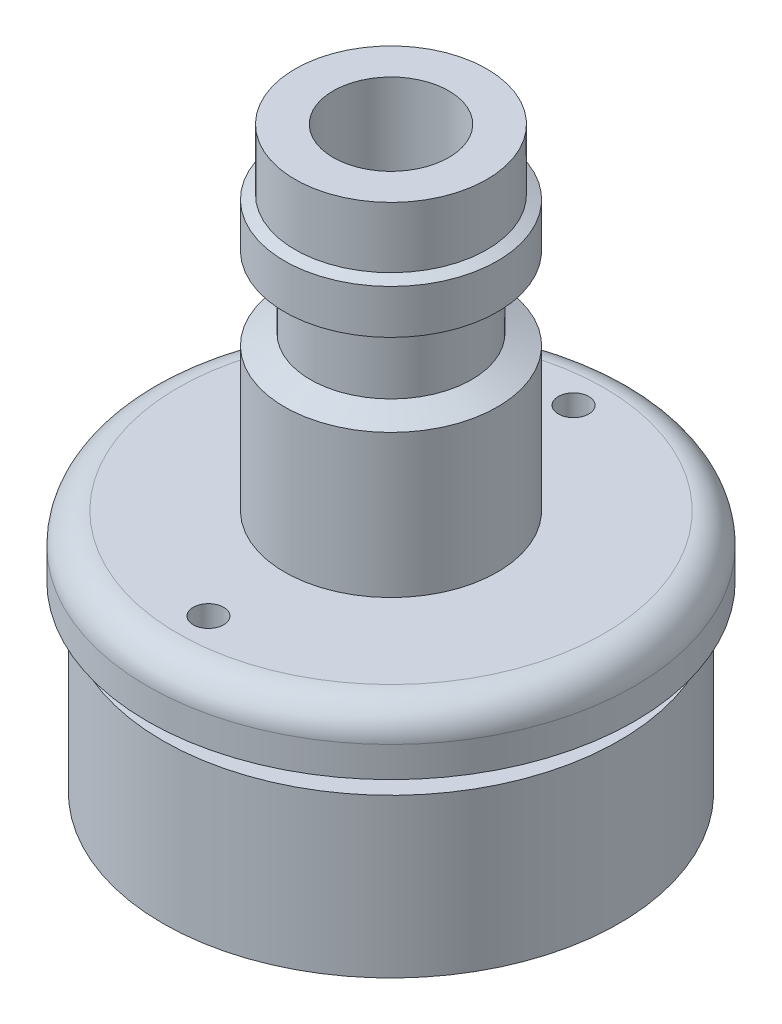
ISO-10303-21;
HEADER;
FILE_DESCRIPTION(('STEP AP214'),'2;1');
FILE_NAME('part.step','',(''),(''),'','','');
FILE_SCHEMA(('AUTOMOTIVE_DESIGN { 1 0 10303 214 1 1 1 1 }'));
ENDSEC;
DATA;
#1=APPLICATION_CONTEXT('core data for automotive mechanical design processes');
#2=APPLICATION_PROTOCOL_DEFINITION('international standard','automotive_design',2000,#1);
#3=PRODUCT_CONTEXT('',#1,'mechanical');
#4=PRODUCT('Part','Part','',(#3));
#5=PRODUCT_RELATED_PRODUCT_CATEGORY('part','',(#4));
#6=PRODUCT_DEFINITION_FORMATION('','',#4);
#7=PRODUCT_DEFINITION_CONTEXT('part definition',#1,'design');
#8=PRODUCT_DEFINITION('design','',#6,#7);
#9=PRODUCT_DEFINITION_SHAPE('','',#8);
#10=(LENGTH_UNIT() NAMED_UNIT(*) SI_UNIT(.MILLI.,.METRE.));
#11=(NAMED_UNIT(*) PLANE_ANGLE_UNIT() SI_UNIT($,.RADIAN.));
#12=(NAMED_UNIT(*) SI_UNIT($,.STERADIAN.) SOLID_ANGLE_UNIT());
#13=UNCERTAINTY_MEASURE_WITH_UNIT(LENGTH_MEASURE(1.E-05),#10,'distance_accuracy_value','');
#14=(GEOMETRIC_REPRESENTATION_CONTEXT(3) GLOBAL_UNCERTAINTY_ASSIGNED_CONTEXT((#13)) GLOBAL_UNIT_ASSIGNED_CONTEXT((#10,
#11,#12)) REPRESENTATION_CONTEXT('',''));
#15=CARTESIAN_POINT('',(0.,0.,0.));
#16=DIRECTION('',(0.,0.,1.));
#17=DIRECTION('',(1.,0.,0.));
#18=AXIS2_PLACEMENT_3D('',#15,#16,#17);
#19=CARTESIAN_POINT('',(8.89,2.54,0.));
#20=DIRECTION('',(0.,1.,0.));
#21=DIRECTION('',(0.,0.,1.));
#22=AXIS2_PLACEMENT_3D('',#19,#20,#21);
#23=PLANE('',#22);
#24=CARTESIAN_POINT('',(0.,2.54,0.));
#25=DIRECTION('',(0.,-1.,0.));
#26=DIRECTION('',(0.,0.,-1.));
#27=AXIS2_PLACEMENT_3D('',#24,#25,#26);
#28=CIRCLE('',#27,8.89);
#29=CARTESIAN_POINT('',(0.,2.54,-8.89));
#30=VERTEX_POINT('',#29);
#31=EDGE_CURVE('E58',#30,#30,#28,.T.);
#32=ORIENTED_EDGE('',*,*,#31,.F.);
#33=EDGE_LOOP('',(#32));
#34=FACE_BOUND('',#33,.T.);
#35=CARTESIAN_POINT('',(0.,2.54,0.));
#36=DIRECTION('',(0.,-1.,0.));
#37=DIRECTION('',(0.,0.,-1.));
#38=AXIS2_PLACEMENT_3D('',#35,#36,#37);
#39=CIRCLE('',#38,4.445);
#40=CARTESIAN_POINT('',(0.,2.54,-4.445));
#41=VERTEX_POINT('',#40);
#42=EDGE_CURVE('E61',#41,#41,#39,.T.);
#43=ORIENTED_EDGE('',*,*,#42,.T.);
#44=EDGE_LOOP('',(#43));
#45=FACE_BOUND('',#44,.T.);
#46=CARTESIAN_POINT('',(0.,2.54,-7.62));
#47=DIRECTION('',(0.,1.,0.));
#48=DIRECTION('',(0.,0.,1.));
#49=AXIS2_PLACEMENT_3D('',#46,#47,#48);
#50=CIRCLE('',#49,0.635);
#51=CARTESIAN_POINT('',(0.,2.54,-6.985));
#52=VERTEX_POINT('',#51);
#53=EDGE_CURVE('E97',#52,#52,#50,.T.);
#54=ORIENTED_EDGE('',*,*,#53,.F.);
#55=EDGE_LOOP('',(#54));
#56=FACE_BOUND('',#55,.T.);
#57=CARTESIAN_POINT('',(0.,2.54,7.62));
#58=DIRECTION('',(0.,-1.,0.));
#59=DIRECTION('',(0.,0.,-1.));
#60=AXIS2_PLACEMENT_3D('',#57,#58,#59);
#61=CIRCLE('',#60,0.635);
#62=CARTESIAN_POINT('',(0.,2.54,6.985));
#63=VERTEX_POINT('',#62);
#64=EDGE_CURVE('E103',#63,#63,#61,.T.);
#65=ORIENTED_EDGE('',*,*,#64,.T.);
#66=EDGE_LOOP('',(#65));
#67=FACE_BOUND('',#66,.T.);
#68=ADVANCED_FACE('F26',(#34,#45,#56,#67),#23,.T.);
#69=CARTESIAN_POINT('',(4.0005,16.51,0.));
#70=DIRECTION('',(0.,1.,0.));
#71=DIRECTION('',(0.,0.,1.));
#72=AXIS2_PLACEMENT_3D('',#69,#70,#71);
#73=PLANE('',#72);
#74=CARTESIAN_POINT('',(0.,16.51,0.));
#75=DIRECTION('',(0.,-1.,0.));
#76=DIRECTION('',(0.,0.,-1.));
#77=AXIS2_PLACEMENT_3D('',#74,#75,#76);
#78=CIRCLE('',#77,4.0005);
#79=CARTESIAN_POINT('',(0.,16.51,-4.0005));
#80=VERTEX_POINT('',#79);
#81=EDGE_CURVE('E82',#80,#80,#78,.T.);
#82=ORIENTED_EDGE('',*,*,#81,.F.);
#83=EDGE_LOOP('',(#82));
#84=FACE_BOUND('',#83,.T.);
#85=CARTESIAN_POINT('',(0.,16.51,0.));
#86=DIRECTION('',(0.,1.,0.));
#87=DIRECTION('',(0.,0.,1.));
#88=AXIS2_PLACEMENT_3D('',#85,#86,#87);
#89=CIRCLE('',#88,2.413);
#90=CARTESIAN_POINT('',(0.,16.51,2.413));
#91=VERTEX_POINT('',#90);
#92=EDGE_CURVE('E91',#91,#91,#89,.T.);
#93=ORIENTED_EDGE('',*,*,#92,.F.);
#94=EDGE_LOOP('',(#93));
#95=FACE_BOUND('',#94,.T.);
#96=ADVANCED_FACE('F124',(#84,#95),#73,.T.);
#97=CARTESIAN_POINT('',(0.,0.,0.));
#98=DIRECTION('',(0.,1.,0.));
#99=DIRECTION('',(0.,0.,1.));
#100=AXIS2_PLACEMENT_3D('',#97,#98,#99);
#101=PLANE('',#100);
#102=CARTESIAN_POINT('',(0.,0.,0.));
#103=DIRECTION('',(0.,1.,0.));
#104=DIRECTION('',(0.,0.,1.));
#105=AXIS2_PLACEMENT_3D('',#102,#103,#104);
#106=CIRCLE('',#105,4.19100000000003);
#107=CARTESIAN_POINT('',(0.,0.,4.19100000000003));
#108=VERTEX_POINT('',#107);
#109=EDGE_CURVE('E33',#108,#108,#106,.T.);
#110=ORIENTED_EDGE('',*,*,#109,.T.);
#111=EDGE_LOOP('',(#110));
#112=FACE_BOUND('',#111,.T.);
#113=CARTESIAN_POINT('',(0.,0.,0.));
#114=DIRECTION('',(0.,1.,0.));
#115=DIRECTION('',(0.,0.,1.));
#116=AXIS2_PLACEMENT_3D('',#113,#114,#115);
#117=CIRCLE('',#116,7.1374);
#118=CARTESIAN_POINT('',(0.,0.,7.1374));
#119=VERTEX_POINT('',#118);
#120=EDGE_CURVE('E88',#119,#119,#117,.T.);
#121=ORIENTED_EDGE('',*,*,#120,.F.);
#122=EDGE_LOOP('',(#121));
#123=FACE_BOUND('',#122,.T.);
#124=ADVANCED_FACE('F132',(#112,#123),#101,.F.);
#125=CARTESIAN_POINT('',(0.,-7.62,0.));
#126=DIRECTION('',(0.,1.,0.));
#127=DIRECTION('',(0.,0.,1.));
#128=AXIS2_PLACEMENT_3D('',#125,#126,#127);
#129=CYLINDRICAL_SURFACE('',#128,9.525);
#130=CARTESIAN_POINT('',(0.,-7.62,0.));
#131=DIRECTION('',(0.,1.,0.));
#132=DIRECTION('',(0.,0.,1.));
#133=AXIS2_PLACEMENT_3D('',#130,#131,#132);
#134=CIRCLE('',#133,9.525);
#135=CARTESIAN_POINT('',(0.,-7.62,9.525));
#136=VERTEX_POINT('',#135);
#137=EDGE_CURVE('E37',#136,#136,#134,.T.);
#138=CARTESIAN_POINT('',(0.,-1.016,0.));
#139=DIRECTION('',(0.,1.,0.));
#140=DIRECTION('',(0.,0.,1.));
#141=AXIS2_PLACEMENT_3D('',#138,#139,#140);
#142=CIRCLE('',#141,9.525);
#143=CARTESIAN_POINT('',(0.,-1.016,9.525));
#144=VERTEX_POINT('',#143);
#145=EDGE_CURVE('E41',#144,#144,#142,.F.);
#146=CARTESIAN_POINT('',(0.,-7.62,9.525));
#147=CARTESIAN_POINT('',(0.,-7.55120833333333,9.525));
#148=CARTESIAN_POINT('',(0.,-7.48241666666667,9.525));
#149=CARTESIAN_POINT('',(0.,-7.34483333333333,9.525));
#150=CARTESIAN_POINT('',(0.,-7.27604166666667,9.525));
#151=CARTESIAN_POINT('',(0.,-7.13845833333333,9.525));
#152=CARTESIAN_POINT('',(0.,-7.06966666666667,9.525));
#153=CARTESIAN_POINT('',(0.,-6.93208333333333,9.525));
#154=CARTESIAN_POINT('',(0.,-6.86329166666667,9.525));
#155=CARTESIAN_POINT('',(0.,-6.72570833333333,9.525));
#156=CARTESIAN_POINT('',(0.,-6.65691666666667,9.525));
#157=CARTESIAN_POINT('',(0.,-6.51933333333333,9.525));
#158=CARTESIAN_POINT('',(0.,-6.45054166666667,9.525));
#159=CARTESIAN_POINT('',(0.,-6.31295833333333,9.525));
#160=CARTESIAN_POINT('',(0.,-6.24416666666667,9.525));
#161=CARTESIAN_POINT('',(0.,-6.10658333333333,9.525));
#162=CARTESIAN_POINT('',(0.,-6.03779166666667,9.525));
#163=CARTESIAN_POINT('',(0.,-5.90020833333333,9.525));
#164=CARTESIAN_POINT('',(0.,-5.83141666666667,9.525));
#165=CARTESIAN_POINT('',(0.,-5.69383333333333,9.525));
#166=CARTESIAN_POINT('',(0.,-5.62504166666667,9.525));
#167=CARTESIAN_POINT('',(0.,-5.48745833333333,9.525));
#168=CARTESIAN_POINT('',(0.,-5.41866666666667,9.525));
#169=CARTESIAN_POINT('',(0.,-5.28108333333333,9.525));
#170=CARTESIAN_POINT('',(0.,-5.21229166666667,9.525));
#171=CARTESIAN_POINT('',(0.,-5.07470833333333,9.525));
#172=CARTESIAN_POINT('',(0.,-5.00591666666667,9.525));
#173=CARTESIAN_POINT('',(0.,-4.86833333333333,9.525));
#174=CARTESIAN_POINT('',(0.,-4.79954166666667,9.525));
#175=CARTESIAN_POINT('',(0.,-4.66195833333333,9.525));
#176=CARTESIAN_POINT('',(0.,-4.59316666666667,9.525));
#177=CARTESIAN_POINT('',(0.,-4.45558333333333,9.525));
#178=CARTESIAN_POINT('',(0.,-4.38679166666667,9.525));
#179=CARTESIAN_POINT('',(0.,-4.24920833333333,9.525));
#180=CARTESIAN_POINT('',(0.,-4.18041666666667,9.525));
#181=CARTESIAN_POINT('',(0.,-4.04283333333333,9.525));
#182=CARTESIAN_POINT('',(0.,-3.97404166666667,9.525));
#183=CARTESIAN_POINT('',(0.,-3.83645833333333,9.525));
#184=CARTESIAN_POINT('',(0.,-3.76766666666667,9.525));
#185=CARTESIAN_POINT('',(0.,-3.63008333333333,9.525));
#186=CARTESIAN_POINT('',(0.,-3.56129166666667,9.525));
#187=CARTESIAN_POINT('',(0.,-3.42370833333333,9.525));
#188=CARTESIAN_POINT('',(0.,-3.35491666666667,9.525));
#189=CARTESIAN_POINT('',(0.,-3.21733333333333,9.525));
#190=CARTESIAN_POINT('',(0.,-3.14854166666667,9.525));
#191=CARTESIAN_POINT('',(0.,-3.01095833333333,9.525));
#192=CARTESIAN_POINT('',(0.,-2.94216666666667,9.525));
#193=CARTESIAN_POINT('',(0.,-2.80458333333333,9.525));
#194=CARTESIAN_POINT('',(0.,-2.73579166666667,9.525));
#195=CARTESIAN_POINT('',(0.,-2.59820833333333,9.525));
#196=CARTESIAN_POINT('',(0.,-2.52941666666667,9.525));
#197=CARTESIAN_POINT('',(0.,-2.39183333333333,9.525));
#198=CARTESIAN_POINT('',(0.,-2.32304166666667,9.525));
#199=CARTESIAN_POINT('',(0.,-2.18545833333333,9.525));
#200=CARTESIAN_POINT('',(0.,-2.11666666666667,9.525));
#201=CARTESIAN_POINT('',(0.,-1.97908333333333,9.525));
#202=CARTESIAN_POINT('',(0.,-1.91029166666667,9.525));
#203=CARTESIAN_POINT('',(0.,-1.77270833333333,9.525));
#204=CARTESIAN_POINT('',(0.,-1.70391666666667,9.525));
#205=CARTESIAN_POINT('',(0.,-1.56633333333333,9.525));
#206=CARTESIAN_POINT('',(0.,-1.49754166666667,9.525));
#207=CARTESIAN_POINT('',(0.,-1.35995833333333,9.525));
#208=CARTESIAN_POINT('',(0.,-1.29116666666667,9.525));
#209=CARTESIAN_POINT('',(0.,-1.15358333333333,9.525));
#210=CARTESIAN_POINT('',(0.,-1.08479166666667,9.525));
#211=CARTESIAN_POINT('',(0.,-1.016,9.525));
#212=B_SPLINE_CURVE_WITH_KNOTS('',3,(#146,#147,#148,#149,#150,#151,#152,#153,#154,#155,#156,
#157,#158,#159,#160,#161,#162,#163,#164,#165,#166,#167,#168,#169,#170,#171,#172,#173,#174,#175,
#176,#177,#178,#179,#180,#181,#182,#183,#184,#185,#186,#187,#188,#189,#190,#191,#192,#193,#194,
#195,#196,#197,#198,#199,#200,#201,#202,#203,#204,#205,#206,#207,#208,#209,#210,#211),
.UNSPECIFIED.,.F.,.F.,(4,2,2,2,2,2,2,2,2,2,2,2,2,2,2,2,2,2,2,2,2,2,2,2,2,2,2,2,2,2,2,2,4),(0.,
0.206375,0.41275,0.619125,0.8255,1.031875,1.23825,1.444625,1.651,1.857375,2.06375,2.270125,
2.4765,2.682875,2.88925,3.095625,3.302,3.508375,3.71475,3.921125,4.1275,4.333875,4.54025,
4.746625,4.953,5.159375,5.36575,5.572125,5.7785,5.984875,6.19125,6.397625,6.604),.UNSPECIFIED.);
#213=EDGE_CURVE('BSEAM28',#136,#144,#212,.T.);
#214=ORIENTED_EDGE('',*,*,#137,.T.);
#215=ORIENTED_EDGE('',*,*,#145,.T.);
#216=ORIENTED_EDGE('',*,*,#213,.T.);
#217=ORIENTED_EDGE('',*,*,#213,.F.);
#218=EDGE_LOOP('',(#214,#216,#215,#217));
#219=FACE_BOUND('',#218,.T.);
#220=ADVANCED_FACE('F28',(#219),#129,.T.);
#221=CARTESIAN_POINT('',(0.,-7.62,0.));
#222=DIRECTION('',(0.,1.,0.));
#223=DIRECTION('',(0.,0.,1.));
#224=AXIS2_PLACEMENT_3D('',#221,#222,#223);
#225=PLANE('',#224);
#226=CARTESIAN_POINT('',(0.,-7.62,0.));
#227=DIRECTION('',(0.,1.,0.));
#228=DIRECTION('',(0.,0.,1.));
#229=AXIS2_PLACEMENT_3D('',#226,#227,#228);
#230=CIRCLE('',#229,7.1374);
#231=CARTESIAN_POINT('',(0.,-7.62,7.1374));
#232=VERTEX_POINT('',#231);
#233=EDGE_CURVE('E85',#232,#232,#230,.T.);
#234=ORIENTED_EDGE('',*,*,#233,.T.);
#235=EDGE_LOOP('',(#234));
#236=FACE_BOUND('',#235,.T.);
#237=ORIENTED_EDGE('',*,*,#137,.F.);
#238=EDGE_LOOP('',(#237));
#239=FACE_BOUND('',#238,.T.);
#240=ADVANCED_FACE('F159',(#236,#239),#225,.F.);
#241=CARTESIAN_POINT('',(0.,-1.016,0.));
#242=DIRECTION('',(0.,1.,0.));
#243=DIRECTION('',(0.,0.,1.));
#244=AXIS2_PLACEMENT_3D('',#241,#242,#243);
#245=PLANE('',#244);
#246=ORIENTED_EDGE('',*,*,#145,.F.);
#247=EDGE_LOOP('',(#246));
#248=FACE_BOUND('',#247,.T.);
#249=CARTESIAN_POINT('',(0.,-1.016,0.));
#250=DIRECTION('',(0.,1.,0.));
#251=DIRECTION('',(0.,0.,1.));
#252=AXIS2_PLACEMENT_3D('',#249,#250,#251);
#253=CIRCLE('',#252,8.509);
#254=CARTESIAN_POINT('',(0.,-1.016,8.509));
#255=VERTEX_POINT('',#254);
#256=EDGE_CURVE('E45',#255,#255,#253,.T.);
#257=ORIENTED_EDGE('',*,*,#256,.F.);
#258=EDGE_LOOP('',(#257));
#259=FACE_BOUND('',#258,.T.);
#260=ADVANCED_FACE('F156',(#248,#259),#245,.T.);
#261=CARTESIAN_POINT('',(0.,-1.016,0.));
#262=DIRECTION('',(0.,1.,0.));
#263=DIRECTION('',(0.,0.,1.));
#264=AXIS2_PLACEMENT_3D('',#261,#262,#263);
#265=CYLINDRICAL_SURFACE('',#264,8.509);
#266=ORIENTED_EDGE('',*,*,#256,.T.);
#267=EDGE_LOOP('',(#266));
#268=FACE_BOUND('',#267,.T.);
#269=CARTESIAN_POINT('',(0.,0.,0.));
#270=DIRECTION('',(0.,1.,0.));
#271=DIRECTION('',(0.,0.,1.));
#272=AXIS2_PLACEMENT_3D('',#269,#270,#271);
#273=CIRCLE('',#272,8.509);
#274=CARTESIAN_POINT('',(0.,0.,8.509));
#275=VERTEX_POINT('',#274);
#276=EDGE_CURVE('E49',#275,#275,#273,.T.);
#277=ORIENTED_EDGE('',*,*,#276,.F.);
#278=EDGE_LOOP('',(#277));
#279=FACE_BOUND('',#278,.T.);
#280=ADVANCED_FACE('F152',(#268,#279),#265,.T.);
#281=CARTESIAN_POINT('',(0.,0.,0.));
#282=DIRECTION('',(0.,-1.,0.));
#283=DIRECTION('',(0.,0.,-1.));
#284=AXIS2_PLACEMENT_3D('',#281,#282,#283);
#285=PLANE('',#284);
#286=ORIENTED_EDGE('',*,*,#276,.T.);
#287=EDGE_LOOP('',(#286));
#288=FACE_BOUND('',#287,.T.);
#289=CARTESIAN_POINT('',(0.,0.,0.));
#290=DIRECTION('',(0.,-1.,0.));
#291=DIRECTION('',(0.,0.,-1.));
#292=AXIS2_PLACEMENT_3D('',#289,#290,#291);
#293=CIRCLE('',#292,10.16);
#294=CARTESIAN_POINT('',(0.,0.,-10.16));
#295=VERTEX_POINT('',#294);
#296=EDGE_CURVE('E52',#295,#295,#293,.T.);
#297=ORIENTED_EDGE('',*,*,#296,.T.);
#298=EDGE_LOOP('',(#297));
#299=FACE_BOUND('',#298,.T.);
#300=ADVANCED_FACE('F148',(#288,#299),#285,.T.);
#301=CARTESIAN_POINT('',(0.,0.,0.));
#302=DIRECTION('',(0.,-1.,0.));
#303=DIRECTION('',(0.,0.,-1.));
#304=AXIS2_PLACEMENT_3D('',#301,#302,#303);
#305=CYLINDRICAL_SURFACE('',#304,10.16);
#306=CARTESIAN_POINT('',(0.,1.27,0.));
#307=DIRECTION('',(0.,-1.,0.));
#308=DIRECTION('',(0.,0.,-1.));
#309=AXIS2_PLACEMENT_3D('',#306,#307,#308);
#310=CIRCLE('',#309,10.16);
#311=CARTESIAN_POINT('',(0.,1.27,-10.16));
#312=VERTEX_POINT('',#311);
#313=EDGE_CURVE('E55',#312,#312,#310,.T.);
#314=ORIENTED_EDGE('',*,*,#313,.T.);
#315=EDGE_LOOP('',(#314));
#316=FACE_BOUND('',#315,.T.);
#317=ORIENTED_EDGE('',*,*,#296,.F.);
#318=EDGE_LOOP('',(#317));
#319=FACE_BOUND('',#318,.T.);
#320=ADVANCED_FACE('F144',(#316,#319),#305,.T.);
#321=CARTESIAN_POINT('',(0.,1.27,0.));
#322=DIRECTION('',(0.,-1.,0.));
#323=DIRECTION('',(0.,0.,-1.));
#324=AXIS2_PLACEMENT_3D('',#321,#322,#323);
#325=TOROIDAL_SURFACE('',#324,8.89,1.27);
#326=ORIENTED_EDGE('',*,*,#31,.T.);
#327=EDGE_LOOP('',(#326));
#328=FACE_BOUND('',#327,.T.);
#329=ORIENTED_EDGE('',*,*,#313,.F.);
#330=EDGE_LOOP('',(#329));
#331=FACE_BOUND('',#330,.T.);
#332=ADVANCED_FACE('F141',(#328,#331),#325,.T.);
#333=CARTESIAN_POINT('',(0.,0.,0.));
#334=DIRECTION('',(0.,-1.,0.));
#335=DIRECTION('',(0.,0.,-1.));
#336=AXIS2_PLACEMENT_3D('',#333,#334,#335);
#337=CYLINDRICAL_SURFACE('',#336,4.445);
#338=CARTESIAN_POINT('',(0.,8.509,0.));
#339=DIRECTION('',(0.,-1.,0.));
#340=DIRECTION('',(0.,0.,-1.));
#341=AXIS2_PLACEMENT_3D('',#338,#339,#340);
#342=CIRCLE('',#341,4.445);
#343=CARTESIAN_POINT('',(0.,8.509,-4.445));
#344=VERTEX_POINT('',#343);
#345=EDGE_CURVE('E64',#344,#344,#342,.T.);
#346=ORIENTED_EDGE('',*,*,#345,.T.);
#347=EDGE_LOOP('',(#346));
#348=FACE_BOUND('',#347,.T.);
#349=ORIENTED_EDGE('',*,*,#42,.F.);
#350=EDGE_LOOP('',(#349));
#351=FACE_BOUND('',#350,.T.);
#352=ADVANCED_FACE('F139',(#348,#351),#337,.T.);
#353=CARTESIAN_POINT('',(0.,8.95614354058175,0.));
#354=DIRECTION('',(0.,-1.,0.));
#355=DIRECTION('',(0.,0.,-1.));
#356=AXIS2_PLACEMENT_3D('',#353,#354,#355);
#357=CONICAL_SURFACE('',#356,3.3655,1.17809724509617);
#358=ORIENTED_EDGE('',*,*,#345,.F.);
#359=EDGE_LOOP('',(#358));
#360=FACE_BOUND('',#359,.T.);
#361=CARTESIAN_POINT('',(0.,8.95614354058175,0.));
#362=DIRECTION('',(0.,-1.,0.));
#363=DIRECTION('',(0.,0.,-1.));
#364=AXIS2_PLACEMENT_3D('',#361,#362,#363);
#365=CIRCLE('',#364,3.3655);
#366=CARTESIAN_POINT('',(0.,8.95614354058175,-3.3655));
#367=VERTEX_POINT('',#366);
#368=EDGE_CURVE('E67',#367,#367,#365,.T.);
#369=ORIENTED_EDGE('',*,*,#368,.T.);
#370=EDGE_LOOP('',(#369));
#371=FACE_BOUND('',#370,.T.);
#372=ADVANCED_FACE('F213',(#360,#371),#357,.T.);
#373=CARTESIAN_POINT('',(0.,0.,0.));
#374=DIRECTION('',(0.,-1.,0.));
#375=DIRECTION('',(0.,0.,-1.));
#376=AXIS2_PLACEMENT_3D('',#373,#374,#375);
#377=CYLINDRICAL_SURFACE('',#376,3.3655);
#378=ORIENTED_EDGE('',*,*,#368,.F.);
#379=EDGE_LOOP('',(#378));
#380=FACE_BOUND('',#379,.T.);
#381=CARTESIAN_POINT('',(0.,11.4961435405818,0.));
#382=DIRECTION('',(0.,-1.,0.));
#383=DIRECTION('',(0.,0.,-1.));
#384=AXIS2_PLACEMENT_3D('',#381,#382,#383);
#385=CIRCLE('',#384,3.3655);
#386=CARTESIAN_POINT('',(0.,11.4961435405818,-3.3655));
#387=VERTEX_POINT('',#386);
#388=EDGE_CURVE('E70',#387,#387,#385,.T.);
#389=ORIENTED_EDGE('',*,*,#388,.T.);
#390=EDGE_LOOP('',(#389));
#391=FACE_BOUND('',#390,.T.);
#392=ADVANCED_FACE('F210',(#380,#391),#377,.T.);
#393=CARTESIAN_POINT('',(0.,11.9432870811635,0.));
#394=DIRECTION('',(0.,1.,0.));
#395=DIRECTION('',(0.,0.,1.));
#396=AXIS2_PLACEMENT_3D('',#393,#394,#395);
#397=CONICAL_SURFACE('',#396,4.445,1.17809724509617);
#398=ORIENTED_EDGE('',*,*,#388,.F.);
#399=EDGE_LOOP('',(#398));
#400=FACE_BOUND('',#399,.T.);
#401=CARTESIAN_POINT('',(0.,11.9432870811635,0.));
#402=DIRECTION('',(0.,-1.,0.));
#403=DIRECTION('',(0.,0.,-1.));
#404=AXIS2_PLACEMENT_3D('',#401,#402,#403);
#405=CIRCLE('',#404,4.445);
#406=CARTESIAN_POINT('',(0.,11.9432870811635,-4.445));
#407=VERTEX_POINT('',#406);
#408=EDGE_CURVE('E73',#407,#407,#405,.T.);
#409=ORIENTED_EDGE('',*,*,#408,.T.);
#410=EDGE_LOOP('',(#409));
#411=FACE_BOUND('',#410,.T.);
#412=ADVANCED_FACE('F206',(#400,#411),#397,.T.);
#413=CARTESIAN_POINT('',(0.,0.,0.));
#414=DIRECTION('',(0.,-1.,0.));
#415=DIRECTION('',(0.,0.,-1.));
#416=AXIS2_PLACEMENT_3D('',#413,#414,#415);
#417=CYLINDRICAL_SURFACE('',#416,4.445);
#418=CARTESIAN_POINT('',(0.,13.7858820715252,0.));
#419=DIRECTION('',(0.,-1.,0.));
#420=DIRECTION('',(0.,0.,-1.));
#421=AXIS2_PLACEMENT_3D('',#418,#419,#420);
#422=CIRCLE('',#421,4.445);
#423=CARTESIAN_POINT('',(0.,13.7858820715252,-4.445));
#424=VERTEX_POINT('',#423);
#425=EDGE_CURVE('E76',#424,#424,#422,.T.);
#426=ORIENTED_EDGE('',*,*,#425,.T.);
#427=EDGE_LOOP('',(#426));
#428=FACE_BOUND('',#427,.T.);
#429=ORIENTED_EDGE('',*,*,#408,.F.);
#430=EDGE_LOOP('',(#429));
#431=FACE_BOUND('',#430,.T.);
#432=ADVANCED_FACE('F202',(#428,#431),#417,.T.);
#433=CARTESIAN_POINT('',(0.,13.7858820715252,0.));
#434=DIRECTION('',(0.,-1.,0.));
#435=DIRECTION('',(0.,0.,-1.));
#436=AXIS2_PLACEMENT_3D('',#433,#434,#435);
#437=CONICAL_SURFACE('',#436,4.445,1.17809724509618);
#438=CARTESIAN_POINT('',(0.,13.97,0.));
#439=DIRECTION('',(0.,-1.,0.));
#440=DIRECTION('',(0.,0.,-1.));
#441=AXIS2_PLACEMENT_3D('',#438,#439,#440);
#442=CIRCLE('',#441,4.0005);
#443=CARTESIAN_POINT('',(0.,13.97,-4.0005));
#444=VERTEX_POINT('',#443);
#445=EDGE_CURVE('E79',#444,#444,#442,.T.);
#446=ORIENTED_EDGE('',*,*,#445,.T.);
#447=EDGE_LOOP('',(#446));
#448=FACE_BOUND('',#447,.T.);
#449=ORIENTED_EDGE('',*,*,#425,.F.);
#450=EDGE_LOOP('',(#449));
#451=FACE_BOUND('',#450,.T.);
#452=ADVANCED_FACE('F198',(#448,#451),#437,.T.);
#453=CARTESIAN_POINT('',(0.,0.,0.));
#454=DIRECTION('',(0.,-1.,0.));
#455=DIRECTION('',(0.,0.,-1.));
#456=AXIS2_PLACEMENT_3D('',#453,#454,#455);
#457=CYLINDRICAL_SURFACE('',#456,4.0005);
#458=ORIENTED_EDGE('',*,*,#81,.T.);
#459=EDGE_LOOP('',(#458));
#460=FACE_BOUND('',#459,.T.);
#461=ORIENTED_EDGE('',*,*,#445,.F.);
#462=EDGE_LOOP('',(#461));
#463=FACE_BOUND('',#462,.T.);
#464=ADVANCED_FACE('F185',(#460,#463),#457,.T.);
#465=CARTESIAN_POINT('',(0.,-7.62,0.));
#466=DIRECTION('',(0.,1.,0.));
#467=DIRECTION('',(0.,0.,1.));
#468=AXIS2_PLACEMENT_3D('',#465,#466,#467);
#469=CYLINDRICAL_SURFACE('',#468,7.1374);
#470=CARTESIAN_POINT('',(0.,-7.62,7.1374));
#471=CARTESIAN_POINT('',(0.,-7.540625,7.1374));
#472=CARTESIAN_POINT('',(0.,-7.46125,7.1374));
#473=CARTESIAN_POINT('',(0.,-7.3025,7.1374));
#474=CARTESIAN_POINT('',(0.,-7.223125,7.1374));
#475=CARTESIAN_POINT('',(0.,-7.064375,7.1374));
#476=CARTESIAN_POINT('',(0.,-6.985,7.1374));
#477=CARTESIAN_POINT('',(0.,-6.82625,7.1374));
#478=CARTESIAN_POINT('',(0.,-6.746875,7.1374));
#479=CARTESIAN_POINT('',(0.,-6.588125,7.1374));
#480=CARTESIAN_POINT('',(0.,-6.50875,7.1374));
#481=CARTESIAN_POINT('',(0.,-6.35,7.1374));
#482=CARTESIAN_POINT('',(0.,-6.270625,7.1374));
#483=CARTESIAN_POINT('',(0.,-6.111875,7.1374));
#484=CARTESIAN_POINT('',(0.,-6.0325,7.1374));
#485=CARTESIAN_POINT('',(0.,-5.87375,7.1374));
#486=CARTESIAN_POINT('',(0.,-5.794375,7.1374));
#487=CARTESIAN_POINT('',(0.,-5.635625,7.1374));
#488=CARTESIAN_POINT('',(0.,-5.55625,7.1374));
#489=CARTESIAN_POINT('',(0.,-5.3975,7.1374));
#490=CARTESIAN_POINT('',(0.,-5.318125,7.1374));
#491=CARTESIAN_POINT('',(0.,-5.159375,7.1374));
#492=CARTESIAN_POINT('',(0.,-5.08,7.1374));
#493=CARTESIAN_POINT('',(0.,-4.92125,7.1374));
#494=CARTESIAN_POINT('',(0.,-4.841875,7.1374));
#495=CARTESIAN_POINT('',(0.,-4.683125,7.1374));
#496=CARTESIAN_POINT('',(0.,-4.60375,7.1374));
#497=CARTESIAN_POINT('',(0.,-4.445,7.1374));
#498=CARTESIAN_POINT('',(0.,-4.365625,7.1374));
#499=CARTESIAN_POINT('',(0.,-4.206875,7.1374));
#500=CARTESIAN_POINT('',(0.,-4.1275,7.1374));
#501=CARTESIAN_POINT('',(0.,-3.96875,7.1374));
#502=CARTESIAN_POINT('',(0.,-3.889375,7.1374));
#503=CARTESIAN_POINT('',(0.,-3.730625,7.1374));
#504=CARTESIAN_POINT('',(0.,-3.65125,7.1374));
#505=CARTESIAN_POINT('',(0.,-3.4925,7.1374));
#506=CARTESIAN_POINT('',(0.,-3.413125,7.1374));
#507=CARTESIAN_POINT('',(0.,-3.254375,7.1374));
#508=CARTESIAN_POINT('',(0.,-3.175,7.1374));
#509=CARTESIAN_POINT('',(0.,-3.01625,7.1374));
#510=CARTESIAN_POINT('',(0.,-2.936875,7.1374));
#511=CARTESIAN_POINT('',(0.,-2.778125,7.1374));
#512=CARTESIAN_POINT('',(0.,-2.69875,7.1374));
#513=CARTESIAN_POINT('',(0.,-2.54,7.1374));
#514=CARTESIAN_POINT('',(0.,-2.460625,7.1374));
#515=CARTESIAN_POINT('',(0.,-2.301875,7.1374));
#516=CARTESIAN_POINT('',(0.,-2.2225,7.1374));
#517=CARTESIAN_POINT('',(0.,-2.06375,7.1374));
#518=CARTESIAN_POINT('',(0.,-1.984375,7.1374));
#519=CARTESIAN_POINT('',(0.,-1.825625,7.1374));
#520=CARTESIAN_POINT('',(0.,-1.74625,7.1374));
#521=CARTESIAN_POINT('',(0.,-1.5875,7.1374));
#522=CARTESIAN_POINT('',(0.,-1.508125,7.1374));
#523=CARTESIAN_POINT('',(0.,-1.349375,7.1374));
#524=CARTESIAN_POINT('',(0.,-1.27,7.1374));
#525=CARTESIAN_POINT('',(0.,-1.11125,7.1374));
#526=CARTESIAN_POINT('',(0.,-1.031875,7.1374));
#527=CARTESIAN_POINT('',(0.,-0.873125,7.1374));
#528=CARTESIAN_POINT('',(0.,-0.79375,7.1374));
#529=CARTESIAN_POINT('',(0.,-0.635,7.1374));
#530=CARTESIAN_POINT('',(0.,-0.555625,7.1374));
#531=CARTESIAN_POINT('',(0.,-0.396875,7.1374));
#532=CARTESIAN_POINT('',(0.,-0.3175,7.1374));
#533=CARTESIAN_POINT('',(0.,-0.15875,7.1374));
#534=CARTESIAN_POINT('',(0.,-0.0793749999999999,7.1374));
#535=CARTESIAN_POINT('',(0.,0.,7.1374));
#536=B_SPLINE_CURVE_WITH_KNOTS('',3,(#470,#471,#472,#473,#474,#475,#476,#477,#478,#479,#480,
#481,#482,#483,#484,#485,#486,#487,#488,#489,#490,#491,#492,#493,#494,#495,#496,#497,#498,#499,
#500,#501,#502,#503,#504,#505,#506,#507,#508,#509,#510,#511,#512,#513,#514,#515,#516,#517,#518,
#519,#520,#521,#522,#523,#524,#525,#526,#527,#528,#529,#530,#531,#532,#533,#534,#535),
.UNSPECIFIED.,.F.,.F.,(4,2,2,2,2,2,2,2,2,2,2,2,2,2,2,2,2,2,2,2,2,2,2,2,2,2,2,2,2,2,2,2,4),(0.,
0.238125,0.47625,0.714375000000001,0.9525,1.190625,1.42875,1.666875,1.905,2.143125,2.38125,
2.619375,2.8575,3.095625,3.33375,3.571875,3.81,4.048125,4.28625,4.524375,4.7625,5.000625,
5.23875,5.476875,5.715,5.953125,6.19125,6.429375,6.6675,6.905625,7.14375,7.381875,7.62),.UNSPECIFIED.);
#537=EDGE_CURVE('BSEAM182',#232,#119,#536,.T.);
#538=ORIENTED_EDGE('',*,*,#233,.F.);
#539=ORIENTED_EDGE('',*,*,#120,.T.);
#540=ORIENTED_EDGE('',*,*,#537,.T.);
#541=ORIENTED_EDGE('',*,*,#537,.F.);
#542=EDGE_LOOP('',(#538,#540,#539,#541));
#543=FACE_BOUND('',#542,.T.);
#544=ADVANCED_FACE('F182',(#543),#469,.F.);
#545=CARTESIAN_POINT('',(0.,16.51,0.));
#546=DIRECTION('',(0.,-1.,0.));
#547=DIRECTION('',(0.,0.,-1.));
#548=AXIS2_PLACEMENT_3D('',#545,#546,#547);
#549=CYLINDRICAL_SURFACE('',#548,2.413);
#550=CARTESIAN_POINT('',(0.,1.77800000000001,0.));
#551=DIRECTION('',(0.,1.,0.));
#552=DIRECTION('',(0.,0.,1.));
#553=AXIS2_PLACEMENT_3D('',#550,#551,#552);
#554=CIRCLE('',#553,2.413);
#555=CARTESIAN_POINT('',(0.,1.77800000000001,2.413));
#556=VERTEX_POINT('',#555);
#557=EDGE_CURVE('E10',#556,#556,#554,.F.);
#558=ORIENTED_EDGE('',*,*,#557,.T.);
#559=EDGE_LOOP('',(#558));
#560=FACE_BOUND('',#559,.T.);
#561=ORIENTED_EDGE('',*,*,#92,.T.);
#562=EDGE_LOOP('',(#561));
#563=FACE_BOUND('',#562,.T.);
#564=ADVANCED_FACE('F184',(#560,#563),#549,.F.);
#565=CARTESIAN_POINT('',(0.,0.,0.));
#566=DIRECTION('',(0.,-1.,0.));
#567=DIRECTION('',(0.,0.,-1.));
#568=AXIS2_PLACEMENT_3D('',#565,#566,#567);
#569=CONICAL_SURFACE('',#568,4.19100000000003,0.785398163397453);
#570=ORIENTED_EDGE('',*,*,#557,.F.);
#571=EDGE_LOOP('',(#570));
#572=FACE_BOUND('',#571,.T.);
#573=ORIENTED_EDGE('',*,*,#109,.F.);
#574=EDGE_LOOP('',(#573));
#575=FACE_BOUND('',#574,.T.);
#576=ADVANCED_FACE('F234',(#572,#575),#569,.F.);
#577=CARTESIAN_POINT('',(0.,1.016,-7.62));
#578=DIRECTION('',(0.,1.,0.));
#579=DIRECTION('',(0.,0.,1.));
#580=AXIS2_PLACEMENT_3D('',#577,#578,#579);
#581=CYLINDRICAL_SURFACE('',#580,0.635);
#582=CARTESIAN_POINT('',(0.,1.016,-7.62));
#583=DIRECTION('',(0.,1.,0.));
#584=DIRECTION('',(0.,0.,1.));
#585=AXIS2_PLACEMENT_3D('',#582,#583,#584);
#586=CIRCLE('',#585,0.635);
#587=CARTESIAN_POINT('',(0.,1.016,-6.985));
#588=VERTEX_POINT('',#587);
#589=EDGE_CURVE('E94',#588,#588,#586,.T.);
#590=ORIENTED_EDGE('',*,*,#589,.F.);
#591=EDGE_LOOP('',(#590));
#592=FACE_BOUND('',#591,.T.);
#593=ORIENTED_EDGE('',*,*,#53,.T.);
#594=EDGE_LOOP('',(#593));
#595=FACE_BOUND('',#594,.T.);
#596=ADVANCED_FACE('F120',(#592,#595),#581,.F.);
#597=CARTESIAN_POINT('',(0.,1.016,-7.62));
#598=DIRECTION('',(0.,1.,0.));
#599=DIRECTION('',(0.,0.,1.));
#600=AXIS2_PLACEMENT_3D('',#597,#598,#599);
#601=PLANE('',#600);
#602=ORIENTED_EDGE('',*,*,#589,.T.);
#603=EDGE_LOOP('',(#602));
#604=FACE_BOUND('',#603,.T.);
#605=ADVANCED_FACE('F111',(#604),#601,.T.);
#606=CARTESIAN_POINT('',(0.,1.016,7.62));
#607=DIRECTION('',(0.,1.,0.));
#608=DIRECTION('',(0.,0.,1.));
#609=AXIS2_PLACEMENT_3D('',#606,#607,#608);
#610=CYLINDRICAL_SURFACE('',#609,0.635);
#611=CARTESIAN_POINT('',(0.,1.016,7.62));
#612=DIRECTION('',(0.,-1.,0.));
#613=DIRECTION('',(0.,0.,-1.));
#614=AXIS2_PLACEMENT_3D('',#611,#612,#613);
#615=CIRCLE('',#614,0.635);
#616=CARTESIAN_POINT('',(0.,1.016,6.985));
#617=VERTEX_POINT('',#616);
#618=EDGE_CURVE('E100',#617,#617,#615,.T.);
#619=ORIENTED_EDGE('',*,*,#618,.T.);
#620=EDGE_LOOP('',(#619));
#621=FACE_BOUND('',#620,.T.);
#622=ORIENTED_EDGE('',*,*,#64,.F.);
#623=EDGE_LOOP('',(#622));
#624=FACE_BOUND('',#623,.T.);
#625=ADVANCED_FACE('F108',(#621,#624),#610,.F.);
#626=CARTESIAN_POINT('',(0.,1.016,7.62));
#627=DIRECTION('',(0.,-1.,0.));
#628=DIRECTION('',(0.,0.,-1.));
#629=AXIS2_PLACEMENT_3D('',#626,#627,#628);
#630=PLANE('',#629);
#631=ORIENTED_EDGE('',*,*,#618,.F.);
#632=EDGE_LOOP('',(#631));
#633=FACE_BOUND('',#632,.T.);
#634=ADVANCED_FACE('F110',(#633),#630,.F.);
#635=CLOSED_SHELL('',(#68,#96,#124,#220,#240,#260,#280,#300,#320,#332,#352,#372,#392,#412,#432,
#452,#464,#544,#564,#576,#596,#605,#625,#634));
#636=MANIFOLD_SOLID_BREP('B2',#635);
#637=ADVANCED_BREP_SHAPE_REPRESENTATION('',(#18,#636),#14);
#638=SHAPE_DEFINITION_REPRESENTATION(#9,#637);
ENDSEC;
END-ISO-10303-21;
